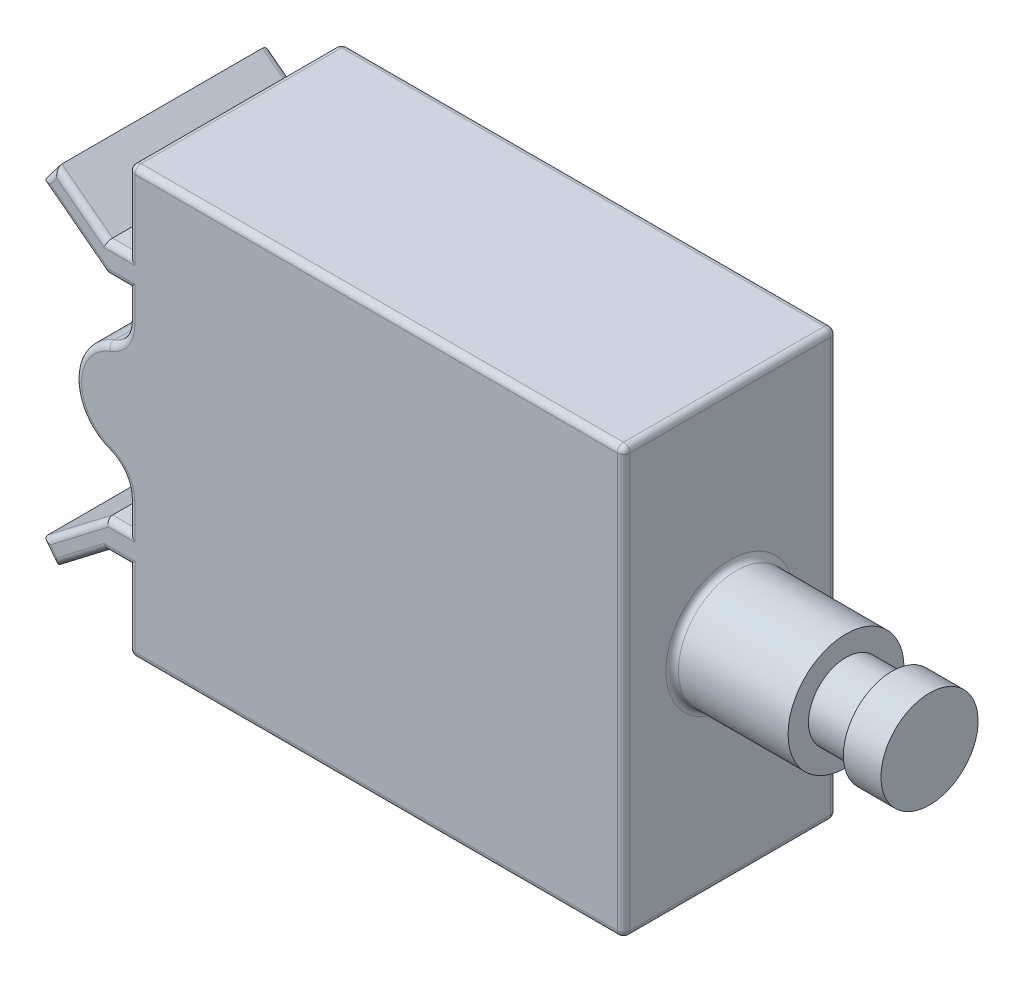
from build123d import *

# Parameters (mm, degrees)
BOSS_EXTRUDE1_DEPTH = 17.272
FILLET1_R           = 2.54
SKETCH2_R           = 4.699
BOSS_EXTRUDE2_DEPTH = 9.398
SKETCH3_R           = 3.048
BOSS_EXTRUDE3_DEPTH = 3.81
SKETCH4_R           = 3.937
BOSS_EXTRUDE4_DEPTH = 3.048
BOSS_EXTRUDE5_DEPTH = 17.272
FILLET2_R           = 0.508


with BuildPart() as part:
    # Sketch1 → Boss-Extrude1 (new body)
    with BuildSketch(Plane.XY):
        with BuildLine():
            Line((0, 0), (40.132, 0))
            Line((40.132, 0), (40.132, 34.544))
            Line((40.132, 34.544), (0, 34.544))
            Line((0, 34.544), (0, 21.336))
            ThreePointArc((0, 21.336), (-3.036971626, 20.236844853), (-4.318, 17.272))
            ThreePointArc((-4.318, 17.272), (-3.036971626, 14.307155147), (0, 13.208))
            Line((0, 13.208), (0, 0))
        make_face()
    extrude(amount=BOSS_EXTRUDE1_DEPTH)

    # Fillet1
    fillet1_edges = [part.edges().sort_by_distance(p)[0] for p in [
        (0, 13.208, 8.636),
        (0, 21.336, 8.636),
    ]]
    fillet(fillet1_edges, radius=FILLET1_R)

    # Sketch2 → Boss-Extrude2 (add)
    with BuildSketch(Plane(origin=(40.132, 0, 0), x_dir=(0, 0, -1), z_dir=(1, 0, 0))):
        with Locations(Location((-8.636, 17.272, 0), (0, 0, 180))):
            Circle(SKETCH2_R)
    extrude(amount=BOSS_EXTRUDE2_DEPTH)

    # Sketch3 → Boss-Extrude3 (add)
    with BuildSketch(Plane(origin=(49.53, 0, 0), x_dir=(0, 0, -1), z_dir=(1, 0, 0))):
        with Locations(Location((-8.636, 17.272, 0), (0, 0, 180))):
            Circle(SKETCH3_R)
    extrude(amount=BOSS_EXTRUDE3_DEPTH)

    # Sketch4 → Boss-Extrude4 (add)
    with BuildSketch(Plane(origin=(53.34, 0, 0), x_dir=(0, 0, -1), z_dir=(1, 0, 0))):
        with Locations(Location((-8.724023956, 17.361263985, 0), (0, 0, 180))):
            Circle(SKETCH4_R)
    extrude(amount=BOSS_EXTRUDE4_DEPTH)

    # Sketch5 → Boss-Extrude5 (add)
    with BuildSketch(Plane.XY.offset(17.272)):
        Polygon((0, 25.825031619), (-1.805990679, 25.825031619), (-7.04254065, 29.83971993), (-5.915955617, 31.30917867), (-1.805990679, 28.158205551), (0, 28.158205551), align=None)
        Polygon((0, 6.385794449), (0, 8.718968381), (-1.805990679, 8.718968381), (-7.04254065, 4.70428007), (-5.915955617, 3.23482133), (-1.805990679, 6.385794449), align=None)
    extrude(amount=-BOSS_EXTRUDE5_DEPTH)

    # Fillet2
    fillet2_edges = [part.edges().sort_by_distance(p)[0] for p in [
        (40.132, 17.272, 17.272),
        (0, 34.544, 8.636),
        (40.132, 34.544, 8.636),
        (40.132, 0, 8.636),
        (0, 0, 8.636),
        (20.066, 34.544, 17.272),
        (0, 31.351102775, 17.272),
        (0, 9.895019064, 0),
        (0, 9.895019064, 17.272),
        (-4.318, 17.272, 0),
        (-4.318, 17.272, 17.272),
        (-0.455580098, 12.522549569, 0),
        (-0.455580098, 12.522549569, 17.272),
        (-0.455580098, 22.021450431, 0),
        (-0.455580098, 22.021450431, 17.272),
        (40.132, 17.272, 3.937),
        (0, 24.648980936, 0),
        (0, 24.648980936, 17.272),
        (-0.90299534, 28.158205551, 17.272),
        (-3.860973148, 29.73369211, 17.272),
        (-6.479248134, 30.5744493, 17.272),
        (-4.424265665, 27.832375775, 17.272),
        (-0.90299534, 25.825031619, 17.272),
        (-0.90299534, 28.158205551, 0),
        (-3.860973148, 29.73369211, 0),
        (-6.479248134, 30.5744493, 0),
        (-4.424265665, 27.832375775, 0),
        (-0.90299534, 25.825031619, 0),
        (0, 3.192897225, 0),
        (0, 3.192897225, 17.272),
        (-0.90299534, 6.385794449, 17.272),
        (-0.90299534, 8.718968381, 17.272),
        (-4.424265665, 6.711624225, 17.272),
        (-6.479248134, 3.9695507, 17.272),
        (-3.860973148, 4.81030789, 17.272),
        (-0.90299534, 8.718968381, 0),
        (-4.424265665, 6.711624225, 0),
        (-6.479248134, 3.9695507, 0),
        (-3.860973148, 4.81030789, 0),
        (-0.90299534, 6.385794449, 0),
        (20.066, 0, 17.272),
        (0, 31.351102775, 0),
        (20.066, 34.544, 0),
        (40.132, 17.272, 0),
        (20.066, 0, 0),
    ]]
    fillet(fillet2_edges, radius=FILLET2_R)


solid = part.part
